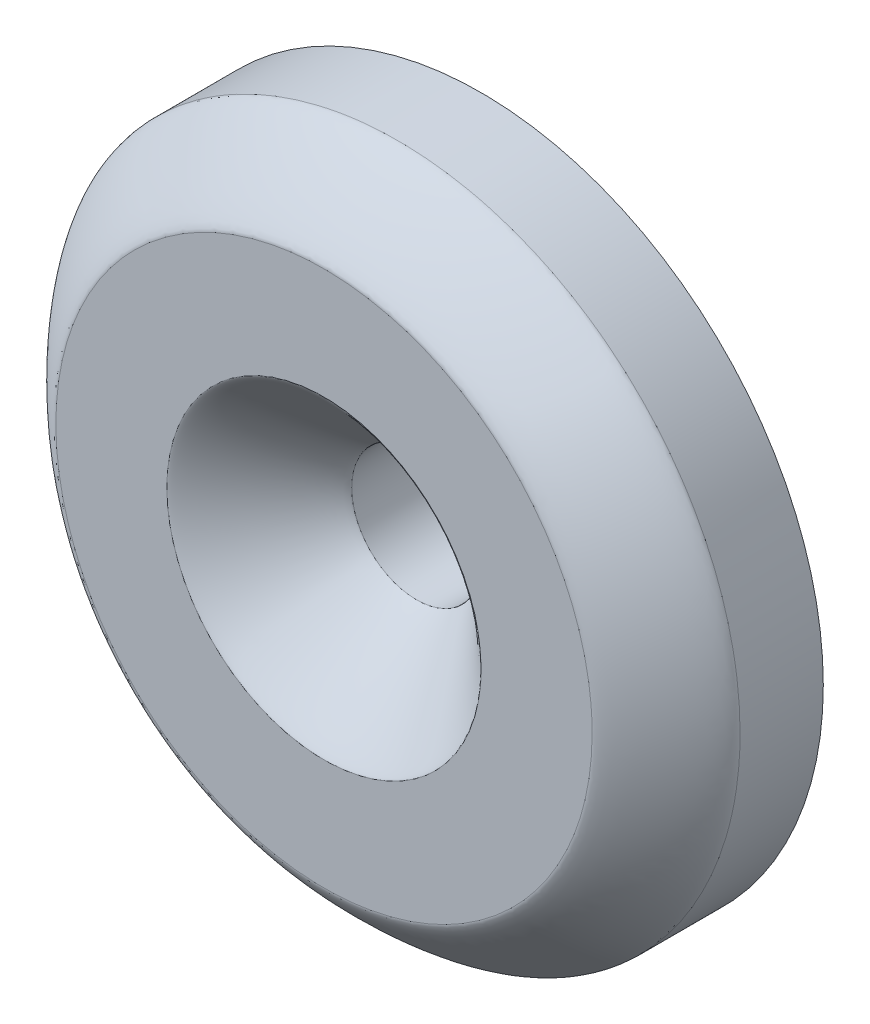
ISO-10303-21;
HEADER;
FILE_DESCRIPTION(('STEP AP214'),'2;1');
FILE_NAME('part.step','',(''),(''),'','','');
FILE_SCHEMA(('AUTOMOTIVE_DESIGN { 1 0 10303 214 1 1 1 1 }'));
ENDSEC;
DATA;
#1=APPLICATION_CONTEXT('core data for automotive mechanical design processes');
#2=APPLICATION_PROTOCOL_DEFINITION('international standard','automotive_design',2000,#1);
#3=PRODUCT_CONTEXT('',#1,'mechanical');
#4=PRODUCT('Part','Part','',(#3));
#5=PRODUCT_RELATED_PRODUCT_CATEGORY('part','',(#4));
#6=PRODUCT_DEFINITION_FORMATION('','',#4);
#7=PRODUCT_DEFINITION_CONTEXT('part definition',#1,'design');
#8=PRODUCT_DEFINITION('design','',#6,#7);
#9=PRODUCT_DEFINITION_SHAPE('','',#8);
#10=(LENGTH_UNIT() NAMED_UNIT(*) SI_UNIT(.MILLI.,.METRE.));
#11=(NAMED_UNIT(*) PLANE_ANGLE_UNIT() SI_UNIT($,.RADIAN.));
#12=(NAMED_UNIT(*) SI_UNIT($,.STERADIAN.) SOLID_ANGLE_UNIT());
#13=UNCERTAINTY_MEASURE_WITH_UNIT(LENGTH_MEASURE(1.E-05),#10,'distance_accuracy_value','');
#14=(GEOMETRIC_REPRESENTATION_CONTEXT(3) GLOBAL_UNCERTAINTY_ASSIGNED_CONTEXT((#13)) GLOBAL_UNIT_ASSIGNED_CONTEXT((#10,
#11,#12)) REPRESENTATION_CONTEXT('',''));
#15=CARTESIAN_POINT('',(0.,0.,0.));
#16=DIRECTION('',(0.,0.,1.));
#17=DIRECTION('',(1.,0.,0.));
#18=AXIS2_PLACEMENT_3D('',#15,#16,#17);
#19=CARTESIAN_POINT('',(0.,0.,0.));
#20=DIRECTION('',(0.,0.,1.));
#21=DIRECTION('',(1.,0.,0.));
#22=AXIS2_PLACEMENT_3D('',#19,#20,#21);
#23=PLANE('',#22);
#24=CARTESIAN_POINT('',(0.,0.,0.));
#25=DIRECTION('',(0.,0.,1.));
#26=DIRECTION('',(1.,0.,0.));
#27=AXIS2_PLACEMENT_3D('',#24,#25,#26);
#28=CIRCLE('',#27,6.);
#29=CARTESIAN_POINT('',(6.,0.,0.));
#30=VERTEX_POINT('',#29);
#31=EDGE_CURVE('E11',#30,#30,#28,.F.);
#32=ORIENTED_EDGE('',*,*,#31,.F.);
#33=EDGE_LOOP('',(#32));
#34=FACE_BOUND('',#33,.T.);
#35=CARTESIAN_POINT('',(0.,0.,0.));
#36=DIRECTION('',(0.,0.,-1.));
#37=DIRECTION('',(-1.,0.,0.));
#38=AXIS2_PLACEMENT_3D('',#35,#36,#37);
#39=CIRCLE('',#38,11.8);
#40=CARTESIAN_POINT('',(-11.8,0.,0.));
#41=VERTEX_POINT('',#40);
#42=EDGE_CURVE('E162',#41,#41,#39,.T.);
#43=ORIENTED_EDGE('',*,*,#42,.T.);
#44=EDGE_LOOP('',(#43));
#45=FACE_BOUND('',#44,.T.);
#46=ADVANCED_FACE('F42',(#34,#45),#23,.F.);
#47=CARTESIAN_POINT('',(0.,0.,0.));
#48=DIRECTION('',(0.,0.,-1.));
#49=DIRECTION('',(-1.,0.,0.));
#50=AXIS2_PLACEMENT_3D('',#47,#48,#49);
#51=CIRCLE('',#50,16.);
#52=CARTESIAN_POINT('',(-16.,0.,0.));
#53=VERTEX_POINT('',#52);
#54=EDGE_CURVE('E169',#53,#53,#51,.T.);
#55=ORIENTED_EDGE('',*,*,#54,.F.);
#56=EDGE_LOOP('',(#55));
#57=FACE_BOUND('',#56,.T.);
#58=CARTESIAN_POINT('',(0.,0.,0.));
#59=DIRECTION('',(0.,0.,1.));
#60=DIRECTION('',(1.,0.,0.));
#61=AXIS2_PLACEMENT_3D('',#58,#59,#60);
#62=CIRCLE('',#61,18.5);
#63=CARTESIAN_POINT('',(18.5,0.,0.));
#64=VERTEX_POINT('',#63);
#65=EDGE_CURVE('E77',#64,#64,#62,.T.);
#66=ORIENTED_EDGE('',*,*,#65,.F.);
#67=EDGE_LOOP('',(#66));
#68=FACE_BOUND('',#67,.T.);
#69=ADVANCED_FACE('F108',(#57,#68),#23,.F.);
#70=CARTESIAN_POINT('',(0.,0.,8.5));
#71=DIRECTION('',(0.,0.,1.));
#72=DIRECTION('',(1.,0.,0.));
#73=AXIS2_PLACEMENT_3D('',#70,#71,#72);
#74=PLANE('',#73);
#75=CARTESIAN_POINT('',(8.5,0.,8.5));
#76=CARTESIAN_POINT('',(8.5,1.11264739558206,8.5));
#77=CARTESIAN_POINT('',(8.27876775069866,2.22485701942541,8.5));
#78=CARTESIAN_POINT('',(7.42718430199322,4.28076133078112,8.5));
#79=CARTESIAN_POINT('',(6.79716815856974,5.22364712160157,8.5));
#80=CARTESIAN_POINT('',(5.22364712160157,6.79716815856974,8.5));
#81=CARTESIAN_POINT('',(4.2807613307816,7.42718430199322,8.5));
#82=CARTESIAN_POINT('',(2.22485701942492,8.27876775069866,8.5));
#83=CARTESIAN_POINT('',(1.11264739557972,8.5,8.5));
#84=CARTESIAN_POINT('',(-1.11264739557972,8.5,8.5));
#85=CARTESIAN_POINT('',(-2.22485701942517,8.27876775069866,8.5));
#86=CARTESIAN_POINT('',(-4.28076133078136,7.42718430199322,8.5));
#87=CARTESIAN_POINT('',(-5.22364712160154,6.79716815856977,8.5));
#88=CARTESIAN_POINT('',(-6.79716815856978,5.22364712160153,8.5));
#89=CARTESIAN_POINT('',(-7.42718430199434,4.28076133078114,8.5));
#90=CARTESIAN_POINT('',(-8.27876775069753,2.22485701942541,8.5));
#91=CARTESIAN_POINT('',(-8.5,1.11264739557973,8.5));
#92=CARTESIAN_POINT('',(-8.5,-1.11264739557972,8.5));
#93=CARTESIAN_POINT('',(-8.2787677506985,-2.22485701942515,8.5));
#94=CARTESIAN_POINT('',(-7.42718430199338,-4.28076133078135,8.5));
#95=CARTESIAN_POINT('',(-6.79716815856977,-5.22364712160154,8.5));
#96=CARTESIAN_POINT('',(-5.22364712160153,-6.79716815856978,8.5));
#97=CARTESIAN_POINT('',(-4.28076133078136,-7.42718430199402,8.5));
#98=CARTESIAN_POINT('',(-2.22485701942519,-8.27876775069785,8.5));
#99=CARTESIAN_POINT('',(-1.11264739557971,-8.5,8.5));
#100=CARTESIAN_POINT('',(1.11264739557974,-8.5,8.5));
#101=CARTESIAN_POINT('',(2.22485701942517,-8.27876775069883,8.5));
#102=CARTESIAN_POINT('',(4.28076133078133,-7.42718430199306,8.5));
#103=CARTESIAN_POINT('',(5.22364712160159,-6.79716815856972,8.5));
#104=CARTESIAN_POINT('',(6.79716815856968,-5.22364712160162,8.5));
#105=CARTESIAN_POINT('',(7.42718430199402,-4.28076133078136,8.5));
#106=CARTESIAN_POINT('',(8.27876775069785,-2.22485701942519,8.5));
#107=CARTESIAN_POINT('',(8.5,-1.11264739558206,8.5));
#108=CARTESIAN_POINT('',(8.5,0.,8.5));
#109=(BOUNDED_CURVE() B_SPLINE_CURVE(3,(#75,#76,#77,#78,#79,#80,#81,#82,#83,#84,#85,#86,#87,#88,
#89,#90,#91,#92,#93,#94,#95,#96,#97,#98,#99,#100,#101,#102,#103,#104,#105,#106,#107,#108),
.UNSPECIFIED.,.T.,.F.) B_SPLINE_CURVE_WITH_KNOTS((4,2,2,2,2,2,2,2,2,2,2,2,2,2,2,2,4),(0.,
0.392699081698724,0.785398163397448,1.17809724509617,1.5707963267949,1.96349540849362,
2.35619449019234,2.74889357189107,3.14159265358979,3.53429173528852,3.92699081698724,
4.31968989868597,4.71238898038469,5.10508806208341,5.49778714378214,5.89048622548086,
6.28318530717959),
.UNSPECIFIED.) CURVE() GEOMETRIC_REPRESENTATION_ITEM() RATIONAL_B_SPLINE_CURVE((1.,1.,1.,1.,1.,
1.,1.,1.,1.,1.,1.,1.,1.,1.,1.,1.,1.,1.,1.,1.,1.,1.,1.,1.,1.,1.,1.,1.,1.,1.,1.,1.,1.,1.)) REPRESENTATION_ITEM(''));
#110=CARTESIAN_POINT('',(8.5,0.,8.5));
#111=VERTEX_POINT('',#110);
#112=EDGE_CURVE('E54',#111,#111,#109,.F.);
#113=ORIENTED_EDGE('',*,*,#112,.T.);
#114=EDGE_LOOP('',(#113));
#115=FACE_BOUND('',#114,.T.);
#116=CARTESIAN_POINT('',(14.5,0.,8.5));
#117=CARTESIAN_POINT('',(14.5,-1.89804556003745,8.5));
#118=CARTESIAN_POINT('',(14.1226038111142,-3.79534432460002,8.5));
#119=CARTESIAN_POINT('',(12.6699026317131,-7.30247521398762,8.5));
#120=CARTESIAN_POINT('',(11.5951692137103,-8.91092744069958,8.5));
#121=CARTESIAN_POINT('',(8.91092744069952,-11.5951692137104,8.5));
#122=CARTESIAN_POINT('',(7.30247521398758,-12.6699026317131,8.5));
#123=CARTESIAN_POINT('',(3.79534432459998,-14.1226038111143,8.5));
#124=CARTESIAN_POINT('',(1.89804556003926,-14.5,8.5));
#125=CARTESIAN_POINT('',(-1.89804556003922,-14.5,8.5));
#126=CARTESIAN_POINT('',(-3.7953443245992,-14.1226038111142,8.5));
#127=CARTESIAN_POINT('',(-7.30247521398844,-12.6699026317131,8.5));
#128=CARTESIAN_POINT('',(-8.9109274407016,-11.5951692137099,8.5));
#129=CARTESIAN_POINT('',(-11.5951692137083,-8.91092744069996,8.5));
#130=CARTESIAN_POINT('',(-12.6699026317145,-7.30247521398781,8.5));
#131=CARTESIAN_POINT('',(-14.1226038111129,-3.79534432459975,8.5));
#132=CARTESIAN_POINT('',(-14.5,-1.89804556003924,8.5));
#133=CARTESIAN_POINT('',(-14.5,1.89804556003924,8.5));
#134=CARTESIAN_POINT('',(-14.1226038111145,3.79534432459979,8.5));
#135=CARTESIAN_POINT('',(-12.6699026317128,7.30247521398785,8.5));
#136=CARTESIAN_POINT('',(-11.5951692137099,8.9109274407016,8.5));
#137=CARTESIAN_POINT('',(-8.91092744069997,11.5951692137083,8.5));
#138=CARTESIAN_POINT('',(-7.30247521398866,12.6699026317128,8.5));
#139=CARTESIAN_POINT('',(-3.79534432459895,14.1226038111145,8.5));
#140=CARTESIAN_POINT('',(-1.89804556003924,14.5,8.5));
#141=CARTESIAN_POINT('',(1.89804556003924,14.5,8.5));
#142=CARTESIAN_POINT('',(3.79534432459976,14.1226038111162,8.5));
#143=CARTESIAN_POINT('',(7.30247521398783,12.6699026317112,8.5));
#144=CARTESIAN_POINT('',(8.91092744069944,11.5951692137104,8.5));
#145=CARTESIAN_POINT('',(11.5951692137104,8.91092744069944,8.5));
#146=CARTESIAN_POINT('',(12.6699026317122,7.30247521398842,8.5));
#147=CARTESIAN_POINT('',(14.1226038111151,3.79534432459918,8.5));
#148=CARTESIAN_POINT('',(14.5,1.89804556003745,8.5));
#149=CARTESIAN_POINT('',(14.5,0.,8.5));
#150=(BOUNDED_CURVE() B_SPLINE_CURVE(3,(#116,#117,#118,#119,#120,#121,#122,#123,#124,#125,#126,
#127,#128,#129,#130,#131,#132,#133,#134,#135,#136,#137,#138,#139,#140,#141,#142,#143,#144,#145,
#146,#147,#148,#149),.UNSPECIFIED.,.T.,.F.) B_SPLINE_CURVE_WITH_KNOTS((4,2,2,2,2,2,2,2,2,2,2,2,
2,2,2,2,4),(0.,0.392699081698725,0.785398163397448,1.17809724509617,1.5707963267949,
1.96349540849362,2.35619449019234,2.74889357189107,3.14159265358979,3.53429173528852,
3.92699081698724,4.31968989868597,4.71238898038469,5.10508806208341,5.49778714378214,
5.89048622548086,6.28318530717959),
.UNSPECIFIED.) CURVE() GEOMETRIC_REPRESENTATION_ITEM() RATIONAL_B_SPLINE_CURVE((1.,1.,1.,1.,1.,
1.,1.,1.,1.,1.,1.,1.,1.,1.,1.,1.,1.,1.,1.,1.,1.,1.,1.,1.,1.,1.,1.,1.,1.,1.,1.,1.,1.,1.)) REPRESENTATION_ITEM(''));
#151=CARTESIAN_POINT('',(14.5,0.,8.5));
#152=VERTEX_POINT('',#151);
#153=EDGE_CURVE('E71',#152,#152,#150,.F.);
#154=ORIENTED_EDGE('',*,*,#153,.T.);
#155=EDGE_LOOP('',(#154));
#156=FACE_BOUND('',#155,.T.);
#157=ADVANCED_FACE('F97',(#115,#156),#74,.T.);
#158=CARTESIAN_POINT('',(0.,0.,8.5));
#159=DIRECTION('',(0.,0.,-1.));
#160=DIRECTION('',(-1.,0.,0.));
#161=AXIS2_PLACEMENT_3D('',#158,#159,#160);
#162=CYLINDRICAL_SURFACE('',#161,18.5);
#163=CARTESIAN_POINT('',(18.5,0.,4.5));
#164=CARTESIAN_POINT('',(18.5,2.42164433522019,4.5));
#165=CARTESIAN_POINT('',(18.0184945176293,4.84233586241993,4.5));
#166=CARTESIAN_POINT('',(16.1650481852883,9.31695113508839,4.5));
#167=CARTESIAN_POINT('',(14.7938365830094,11.3691143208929,4.5));
#168=CARTESIAN_POINT('',(11.3691143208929,14.7938365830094,4.5));
#169=CARTESIAN_POINT('',(9.31695113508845,16.1650481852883,4.5));
#170=CARTESIAN_POINT('',(4.84233586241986,18.0184945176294,4.5));
#171=CARTESIAN_POINT('',(2.42164433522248,18.5,4.5));
#172=CARTESIAN_POINT('',(-2.42164433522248,18.5,4.5));
#173=CARTESIAN_POINT('',(-4.84233586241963,18.0184945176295,4.5));
#174=CARTESIAN_POINT('',(-9.3169511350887,16.1650481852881,4.5));
#175=CARTESIAN_POINT('',(-11.369114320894,14.7938365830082,4.5));
#176=CARTESIAN_POINT('',(-14.7938365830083,11.369114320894,4.5));
#177=CARTESIAN_POINT('',(-16.1650481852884,9.31695113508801,4.5));
#178=CARTESIAN_POINT('',(-18.0184945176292,4.84233586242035,4.5));
#179=CARTESIAN_POINT('',(-18.5,2.42164433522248,4.5));
#180=CARTESIAN_POINT('',(-18.5,-2.42164433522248,4.5));
#181=CARTESIAN_POINT('',(-18.0184945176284,-4.84233586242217,4.5));
#182=CARTESIAN_POINT('',(-16.1650481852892,-9.3169511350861,4.5));
#183=CARTESIAN_POINT('',(-14.7938365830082,-11.369114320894,4.5));
#184=CARTESIAN_POINT('',(-11.369114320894,-14.7938365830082,4.5));
#185=CARTESIAN_POINT('',(-9.31695113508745,-16.1650481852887,4.5));
#186=CARTESIAN_POINT('',(-4.84233586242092,-18.0184945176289,4.5));
#187=CARTESIAN_POINT('',(-2.42164433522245,-18.5,4.5));
#188=CARTESIAN_POINT('',(2.42164433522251,-18.5,4.5));
#189=CARTESIAN_POINT('',(4.84233586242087,-18.0184945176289,4.5));
#190=CARTESIAN_POINT('',(9.3169511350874,-16.1650481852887,4.5));
#191=CARTESIAN_POINT('',(11.369114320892,-14.7938365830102,4.5));
#192=CARTESIAN_POINT('',(14.7938365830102,-11.3691143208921,4.5));
#193=CARTESIAN_POINT('',(16.1650481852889,-9.31695113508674,4.5));
#194=CARTESIAN_POINT('',(18.0184945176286,-4.84233586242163,4.5));
#195=CARTESIAN_POINT('',(18.5,-2.42164433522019,4.5));
#196=CARTESIAN_POINT('',(18.5,0.,4.5));
#197=(BOUNDED_CURVE() B_SPLINE_CURVE(3,(#163,#164,#165,#166,#167,#168,#169,#170,#171,#172,#173,
#174,#175,#176,#177,#178,#179,#180,#181,#182,#183,#184,#185,#186,#187,#188,#189,#190,#191,#192,
#193,#194,#195,#196),.UNSPECIFIED.,.T.,.F.) B_SPLINE_CURVE_WITH_KNOTS((4,2,2,2,2,2,2,2,2,2,2,2,
2,2,2,2,4),(0.,0.392699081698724,0.785398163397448,1.17809724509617,1.5707963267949,
1.96349540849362,2.35619449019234,2.74889357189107,3.14159265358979,3.53429173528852,
3.92699081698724,4.31968989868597,4.71238898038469,5.10508806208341,5.49778714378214,
5.89048622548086,6.28318530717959),
.UNSPECIFIED.) CURVE() GEOMETRIC_REPRESENTATION_ITEM() RATIONAL_B_SPLINE_CURVE((1.,1.,1.,1.,1.,
1.,1.,1.,1.,1.,1.,1.,1.,1.,1.,1.,1.,1.,1.,1.,1.,1.,1.,1.,1.,1.,1.,1.,1.,1.,1.,1.,1.,1.)) REPRESENTATION_ITEM(''));
#198=CARTESIAN_POINT('',(18.5,0.,4.5));
#199=VERTEX_POINT('',#198);
#200=EDGE_CURVE('E65',#199,#199,#197,.F.);
#201=ORIENTED_EDGE('',*,*,#200,.T.);
#202=EDGE_LOOP('',(#201));
#203=FACE_BOUND('',#202,.T.);
#204=ORIENTED_EDGE('',*,*,#65,.T.);
#205=EDGE_LOOP('',(#204));
#206=FACE_BOUND('',#205,.T.);
#207=ADVANCED_FACE('F107',(#203,#206),#162,.T.);
#208=CARTESIAN_POINT('',(0.,0.,8.5));
#209=DIRECTION('',(0.,0.,-1.));
#210=DIRECTION('',(-1.,0.,0.));
#211=AXIS2_PLACEMENT_3D('',#208,#209,#210);
#212=CYLINDRICAL_SURFACE('',#211,3.5);
#213=CARTESIAN_POINT('',(3.5,0.,3.5));
#214=CARTESIAN_POINT('',(3.5,-0.458148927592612,3.5));
#215=CARTESIAN_POINT('',(3.40890436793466,-0.916117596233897,3.5));
#216=CARTESIAN_POINT('',(3.05825235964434,-1.76266643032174,3.5));
#217=CARTESIAN_POINT('',(2.79883394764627,-2.15091352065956,3.5));
#218=CARTESIAN_POINT('',(2.15091352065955,-2.79883394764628,3.5));
#219=CARTESIAN_POINT('',(1.76266643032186,-3.05825235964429,3.5));
#220=CARTESIAN_POINT('',(0.916117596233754,-3.40890436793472,3.5));
#221=CARTESIAN_POINT('',(0.458148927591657,-3.5,3.5));
#222=CARTESIAN_POINT('',(-0.458148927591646,-3.5,3.5));
#223=CARTESIAN_POINT('',(-0.9161175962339,-3.40890436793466,3.5));
#224=CARTESIAN_POINT('',(-1.76266643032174,-3.05825235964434,3.5));
#225=CARTESIAN_POINT('',(-2.1509135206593,-2.79883394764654,3.5));
#226=CARTESIAN_POINT('',(-2.79883394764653,-2.1509135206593,3.5));
#227=CARTESIAN_POINT('',(-3.05825235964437,-1.76266643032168,3.5));
#228=CARTESIAN_POINT('',(-3.40890436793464,-0.91611759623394,3.5));
#229=CARTESIAN_POINT('',(-3.5,-0.458148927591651,3.5));
#230=CARTESIAN_POINT('',(-3.5,0.458148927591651,3.5));
#231=CARTESIAN_POINT('',(-3.40890436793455,0.916117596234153,3.5));
#232=CARTESIAN_POINT('',(-3.05825235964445,1.76266643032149,3.5));
#233=CARTESIAN_POINT('',(-2.79883394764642,2.15091352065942,3.5));
#234=CARTESIAN_POINT('',(-2.15091352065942,2.79883394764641,3.5));
#235=CARTESIAN_POINT('',(-1.76266643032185,3.0582523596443,3.5));
#236=CARTESIAN_POINT('',(-0.916117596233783,3.40890436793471,3.5));
#237=CARTESIAN_POINT('',(-0.458148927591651,3.5,3.5));
#238=CARTESIAN_POINT('',(0.458148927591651,3.5,3.5));
#239=CARTESIAN_POINT('',(0.91611759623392,3.40890436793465,3.5));
#240=CARTESIAN_POINT('',(1.76266643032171,3.05825235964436,3.5));
#241=CARTESIAN_POINT('',(2.15091352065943,2.79883394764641,3.5));
#242=CARTESIAN_POINT('',(2.79883394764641,2.15091352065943,3.5));
#243=CARTESIAN_POINT('',(3.05825235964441,1.76266643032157,3.5));
#244=CARTESIAN_POINT('',(3.40890436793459,0.916117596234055,3.5));
#245=CARTESIAN_POINT('',(3.5,0.458148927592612,3.5));
#246=CARTESIAN_POINT('',(3.5,0.,3.5));
#247=(BOUNDED_CURVE() B_SPLINE_CURVE(3,(#213,#214,#215,#216,#217,#218,#219,#220,#221,#222,#223,
#224,#225,#226,#227,#228,#229,#230,#231,#232,#233,#234,#235,#236,#237,#238,#239,#240,#241,#242,
#243,#244,#245,#246),.UNSPECIFIED.,.T.,.F.) B_SPLINE_CURVE_WITH_KNOTS((4,2,2,2,2,2,2,2,2,2,2,2,
2,2,2,2,4),(0.,0.392699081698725,0.785398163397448,1.17809724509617,1.5707963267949,
1.96349540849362,2.35619449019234,2.74889357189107,3.14159265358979,3.53429173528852,
3.92699081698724,4.31968989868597,4.71238898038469,5.10508806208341,5.49778714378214,
5.89048622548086,6.28318530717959),
.UNSPECIFIED.) CURVE() GEOMETRIC_REPRESENTATION_ITEM() RATIONAL_B_SPLINE_CURVE((1.,1.,1.,1.,1.,
1.,1.,1.,1.,1.,1.,1.,1.,1.,1.,1.,1.,1.,1.,1.,1.,1.,1.,1.,1.,1.,1.,1.,1.,1.,1.,1.,1.,1.)) REPRESENTATION_ITEM(''));
#248=CARTESIAN_POINT('',(3.5,0.,3.5));
#249=VERTEX_POINT('',#248);
#250=EDGE_CURVE('E59',#249,#249,#247,.F.);
#251=ORIENTED_EDGE('',*,*,#250,.T.);
#252=EDGE_LOOP('',(#251));
#253=FACE_BOUND('',#252,.T.);
#254=CARTESIAN_POINT('',(0.,0.,-2.));
#255=DIRECTION('',(0.,0.,-1.));
#256=DIRECTION('',(-1.,0.,0.));
#257=AXIS2_PLACEMENT_3D('',#254,#255,#256);
#258=CIRCLE('',#257,3.5);
#259=CARTESIAN_POINT('',(-3.5,0.,-2.));
#260=VERTEX_POINT('',#259);
#261=EDGE_CURVE('E89',#260,#260,#258,.T.);
#262=ORIENTED_EDGE('',*,*,#261,.T.);
#263=EDGE_LOOP('',(#262));
#264=FACE_BOUND('',#263,.T.);
#265=ADVANCED_FACE('F109',(#253,#264),#212,.F.);
#266=CARTESIAN_POINT('',(14.5,0.,8.5));
#267=CARTESIAN_POINT('',(14.5,1.89804556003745,8.5));
#268=CARTESIAN_POINT('',(14.1226038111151,3.79534432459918,8.5));
#269=CARTESIAN_POINT('',(12.6699026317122,7.30247521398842,8.5));
#270=CARTESIAN_POINT('',(11.5951692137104,8.91092744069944,8.5));
#271=CARTESIAN_POINT('',(8.91092744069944,11.5951692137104,8.5));
#272=CARTESIAN_POINT('',(7.30247521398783,12.6699026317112,8.5));
#273=CARTESIAN_POINT('',(3.79534432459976,14.1226038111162,8.5));
#274=CARTESIAN_POINT('',(1.89804556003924,14.5,8.5));
#275=CARTESIAN_POINT('',(-1.89804556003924,14.5,8.5));
#276=CARTESIAN_POINT('',(-3.79534432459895,14.1226038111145,8.5));
#277=CARTESIAN_POINT('',(-7.30247521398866,12.6699026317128,8.5));
#278=CARTESIAN_POINT('',(-8.91092744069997,11.5951692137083,8.5));
#279=CARTESIAN_POINT('',(-11.5951692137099,8.9109274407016,8.5));
#280=CARTESIAN_POINT('',(-12.6699026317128,7.30247521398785,8.5));
#281=CARTESIAN_POINT('',(-14.1226038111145,3.79534432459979,8.5));
#282=CARTESIAN_POINT('',(-14.5,1.89804556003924,8.5));
#283=CARTESIAN_POINT('',(-14.5,-1.89804556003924,8.5));
#284=CARTESIAN_POINT('',(-14.1226038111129,-3.79534432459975,8.5));
#285=CARTESIAN_POINT('',(-12.6699026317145,-7.30247521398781,8.5));
#286=CARTESIAN_POINT('',(-11.5951692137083,-8.91092744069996,8.5));
#287=CARTESIAN_POINT('',(-8.9109274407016,-11.5951692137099,8.5));
#288=CARTESIAN_POINT('',(-7.30247521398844,-12.6699026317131,8.5));
#289=CARTESIAN_POINT('',(-3.7953443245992,-14.1226038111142,8.5));
#290=CARTESIAN_POINT('',(-1.89804556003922,-14.5,8.5));
#291=CARTESIAN_POINT('',(1.89804556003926,-14.5,8.5));
#292=CARTESIAN_POINT('',(3.79534432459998,-14.1226038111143,8.5));
#293=CARTESIAN_POINT('',(7.30247521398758,-12.6699026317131,8.5));
#294=CARTESIAN_POINT('',(8.91092744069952,-11.5951692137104,8.5));
#295=CARTESIAN_POINT('',(11.5951692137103,-8.91092744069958,8.5));
#296=CARTESIAN_POINT('',(12.6699026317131,-7.30247521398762,8.5));
#297=CARTESIAN_POINT('',(14.1226038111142,-3.79534432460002,8.5));
#298=CARTESIAN_POINT('',(14.5,-1.89804556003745,8.5));
#299=CARTESIAN_POINT('',(14.5,0.,8.5));
#300=CARTESIAN_POINT('',(18.5,0.,8.5));
#301=CARTESIAN_POINT('',(18.5,2.42164433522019,8.5));
#302=CARTESIAN_POINT('',(18.0184945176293,4.84233586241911,8.5));
#303=CARTESIAN_POINT('',(16.1650481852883,9.31695113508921,8.5));
#304=CARTESIAN_POINT('',(14.7938365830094,11.3691143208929,8.5));
#305=CARTESIAN_POINT('',(11.3691143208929,14.7938365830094,8.5));
#306=CARTESIAN_POINT('',(9.31695113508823,16.1650481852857,8.50000000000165));
#307=CARTESIAN_POINT('',(4.84233586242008,18.0184945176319,8.49999999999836));
#308=CARTESIAN_POINT('',(2.42164433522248,18.5,8.5));
#309=CARTESIAN_POINT('',(-2.42164433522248,18.5,8.5));
#310=CARTESIAN_POINT('',(-4.84233586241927,18.0184945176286,8.49999999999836));
#311=CARTESIAN_POINT('',(-9.31695113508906,16.165048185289,8.50000000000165));
#312=CARTESIAN_POINT('',(-11.369114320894,14.7938365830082,8.5));
#313=CARTESIAN_POINT('',(-14.7938365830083,11.369114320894,8.5));
#314=CARTESIAN_POINT('',(-16.165048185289,9.31695113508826,8.5));
#315=CARTESIAN_POINT('',(-18.0184945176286,4.84233586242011,8.5));
#316=CARTESIAN_POINT('',(-18.5,2.42164433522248,8.5));
#317=CARTESIAN_POINT('',(-18.5,-2.42164433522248,8.5));
#318=CARTESIAN_POINT('',(-18.0184945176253,-4.84233586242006,8.5));
#319=CARTESIAN_POINT('',(-16.1650481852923,-9.31695113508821,8.5));
#320=CARTESIAN_POINT('',(-14.7938365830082,-11.369114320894,8.5));
#321=CARTESIAN_POINT('',(-11.369114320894,-14.7938365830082,8.5));
#322=CARTESIAN_POINT('',(-9.31695113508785,-16.1650481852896,8.50000000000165));
#323=CARTESIAN_POINT('',(-4.84233586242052,-18.018494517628,8.49999999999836));
#324=CARTESIAN_POINT('',(-2.42164433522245,-18.5,8.5));
#325=CARTESIAN_POINT('',(2.42164433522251,-18.5,8.5));
#326=CARTESIAN_POINT('',(4.84233586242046,-18.018494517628,8.5));
#327=CARTESIAN_POINT('',(9.3169511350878,-16.1650481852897,8.5));
#328=CARTESIAN_POINT('',(11.3691143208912,-14.7938365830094,8.5));
#329=CARTESIAN_POINT('',(14.793836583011,-11.3691143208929,8.5));
#330=CARTESIAN_POINT('',(16.1650481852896,-9.31695113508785,8.50000000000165));
#331=CARTESIAN_POINT('',(18.018494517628,-4.84233586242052,8.49999999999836));
#332=CARTESIAN_POINT('',(18.5,-2.42164433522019,8.5));
#333=CARTESIAN_POINT('',(18.5,0.,8.5));
#334=CARTESIAN_POINT('',(18.5,0.,4.5));
#335=CARTESIAN_POINT('',(18.5,2.42164433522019,4.5));
#336=CARTESIAN_POINT('',(18.0184945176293,4.84233586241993,4.5));
#337=CARTESIAN_POINT('',(16.1650481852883,9.31695113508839,4.5));
#338=CARTESIAN_POINT('',(14.7938365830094,11.3691143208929,4.5));
#339=CARTESIAN_POINT('',(11.3691143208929,14.7938365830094,4.5));
#340=CARTESIAN_POINT('',(9.31695113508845,16.1650481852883,4.5));
#341=CARTESIAN_POINT('',(4.84233586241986,18.0184945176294,4.5));
#342=CARTESIAN_POINT('',(2.42164433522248,18.5,4.5));
#343=CARTESIAN_POINT('',(-2.42164433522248,18.5,4.5));
#344=CARTESIAN_POINT('',(-4.84233586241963,18.0184945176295,4.5));
#345=CARTESIAN_POINT('',(-9.3169511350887,16.1650481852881,4.5));
#346=CARTESIAN_POINT('',(-11.369114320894,14.7938365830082,4.5));
#347=CARTESIAN_POINT('',(-14.7938365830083,11.369114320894,4.5));
#348=CARTESIAN_POINT('',(-16.1650481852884,9.31695113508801,4.5));
#349=CARTESIAN_POINT('',(-18.0184945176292,4.84233586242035,4.5));
#350=CARTESIAN_POINT('',(-18.5,2.42164433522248,4.5));
#351=CARTESIAN_POINT('',(-18.5,-2.42164433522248,4.5));
#352=CARTESIAN_POINT('',(-18.0184945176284,-4.84233586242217,4.5));
#353=CARTESIAN_POINT('',(-16.1650481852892,-9.3169511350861,4.5));
#354=CARTESIAN_POINT('',(-14.7938365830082,-11.369114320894,4.5));
#355=CARTESIAN_POINT('',(-11.369114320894,-14.7938365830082,4.5));
#356=CARTESIAN_POINT('',(-9.31695113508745,-16.1650481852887,4.5));
#357=CARTESIAN_POINT('',(-4.84233586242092,-18.0184945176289,4.5));
#358=CARTESIAN_POINT('',(-2.42164433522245,-18.5,4.5));
#359=CARTESIAN_POINT('',(2.42164433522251,-18.5,4.5));
#360=CARTESIAN_POINT('',(4.84233586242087,-18.0184945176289,4.5));
#361=CARTESIAN_POINT('',(9.3169511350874,-16.1650481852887,4.5));
#362=CARTESIAN_POINT('',(11.369114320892,-14.7938365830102,4.5));
#363=CARTESIAN_POINT('',(14.7938365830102,-11.3691143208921,4.5));
#364=CARTESIAN_POINT('',(16.1650481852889,-9.31695113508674,4.5));
#365=CARTESIAN_POINT('',(18.0184945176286,-4.84233586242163,4.5));
#366=CARTESIAN_POINT('',(18.5,-2.42164433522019,4.5));
#367=CARTESIAN_POINT('',(18.5,0.,4.5));
#368=(BOUNDED_SURFACE() B_SPLINE_SURFACE(2,3,((#266,#267,#268,#269,#270,#271,#272,#273,#274,
#275,#276,#277,#278,#279,#280,#281,#282,#283,#284,#285,#286,#287,#288,#289,#290,#291,#292,#293,
#294,#295,#296,#297,#298,#299),(#300,#301,#302,#303,#304,#305,#306,#307,#308,#309,#310,#311,
#312,#313,#314,#315,#316,#317,#318,#319,#320,#321,#322,#323,#324,#325,#326,#327,#328,#329,#330,
#331,#332,#333),(#334,#335,#336,#337,#338,#339,#340,#341,#342,#343,#344,#345,#346,#347,#348,
#349,#350,#351,#352,#353,#354,#355,#356,#357,#358,#359,#360,#361,#362,#363,#364,#365,#366,
#367)),.UNSPECIFIED.,.F.,.T.,.F.) B_SPLINE_SURFACE_WITH_KNOTS((3,3),(4,2,2,2,2,2,2,2,2,2,2,2,2,
2,2,2,4),(0.,1.),(0.,0.392699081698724,0.785398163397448,1.17809724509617,1.5707963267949,
1.96349540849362,2.35619449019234,2.74889357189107,3.14159265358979,3.53429173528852,
3.92699081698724,4.31968989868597,4.71238898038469,5.10508806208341,5.49778714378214,
5.89048622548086,6.28318530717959),
.UNSPECIFIED.) GEOMETRIC_REPRESENTATION_ITEM() RATIONAL_B_SPLINE_SURFACE(((1.,1.,1.,1.,1.,1.,1.,
1.,1.,1.,1.,1.,1.,1.,1.,1.,1.,1.,1.,1.,1.,1.,1.,1.,1.,1.,1.,1.,1.,1.,1.,1.,1.,1.),
(0.14142135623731,0.14142135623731,0.14142135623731,0.14142135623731,0.14142135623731,
0.14142135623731,0.14142135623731,0.14142135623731,0.14142135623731,0.14142135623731,
0.14142135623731,0.14142135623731,0.14142135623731,0.14142135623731,0.141421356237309,
0.141421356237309,0.14142135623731,0.14142135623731,0.141421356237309,0.141421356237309,
0.14142135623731,0.14142135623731,0.141421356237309,0.141421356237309,0.14142135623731,
0.14142135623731,0.141421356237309,0.141421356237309,0.14142135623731,0.14142135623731,
0.141421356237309,0.141421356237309,0.14142135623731,0.14142135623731),(1.,1.,1.,1.,1.,1.,1.,1.,
1.,1.,1.,1.,1.,1.,1.,1.,1.,1.,1.,1.,1.,1.,1.,1.,1.,1.,1.,1.,1.,1.,1.,1.,1.,1.))) REPRESENTATION_ITEM('') SURFACE());
#369=ORIENTED_EDGE('',*,*,#200,.F.);
#370=EDGE_LOOP('',(#369));
#371=FACE_BOUND('',#370,.T.);
#372=ORIENTED_EDGE('',*,*,#153,.F.);
#373=EDGE_LOOP('',(#372));
#374=FACE_BOUND('',#373,.T.);
#375=ADVANCED_FACE('F144',(#371,#374),#368,.T.);
#376=CARTESIAN_POINT('',(3.5,0.,3.5));
#377=CARTESIAN_POINT('',(3.5,0.458148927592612,3.5));
#378=CARTESIAN_POINT('',(3.40890436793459,0.916117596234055,3.5));
#379=CARTESIAN_POINT('',(3.05825235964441,1.76266643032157,3.5));
#380=CARTESIAN_POINT('',(2.79883394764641,2.15091352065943,3.5));
#381=CARTESIAN_POINT('',(2.15091352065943,2.79883394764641,3.5));
#382=CARTESIAN_POINT('',(1.76266643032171,3.05825235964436,3.5));
#383=CARTESIAN_POINT('',(0.91611759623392,3.40890436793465,3.5));
#384=CARTESIAN_POINT('',(0.458148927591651,3.5,3.5));
#385=CARTESIAN_POINT('',(-0.458148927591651,3.5,3.5));
#386=CARTESIAN_POINT('',(-0.916117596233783,3.40890436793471,3.5));
#387=CARTESIAN_POINT('',(-1.76266643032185,3.0582523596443,3.5));
#388=CARTESIAN_POINT('',(-2.15091352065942,2.79883394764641,3.5));
#389=CARTESIAN_POINT('',(-2.79883394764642,2.15091352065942,3.5));
#390=CARTESIAN_POINT('',(-3.05825235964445,1.76266643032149,3.5));
#391=CARTESIAN_POINT('',(-3.40890436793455,0.916117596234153,3.5));
#392=CARTESIAN_POINT('',(-3.5,0.458148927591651,3.5));
#393=CARTESIAN_POINT('',(-3.5,-0.458148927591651,3.5));
#394=CARTESIAN_POINT('',(-3.40890436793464,-0.91611759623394,3.5));
#395=CARTESIAN_POINT('',(-3.05825235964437,-1.76266643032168,3.5));
#396=CARTESIAN_POINT('',(-2.79883394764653,-2.1509135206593,3.5));
#397=CARTESIAN_POINT('',(-2.1509135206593,-2.79883394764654,3.5));
#398=CARTESIAN_POINT('',(-1.76266643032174,-3.05825235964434,3.5));
#399=CARTESIAN_POINT('',(-0.9161175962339,-3.40890436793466,3.5));
#400=CARTESIAN_POINT('',(-0.458148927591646,-3.5,3.5));
#401=CARTESIAN_POINT('',(0.458148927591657,-3.5,3.5));
#402=CARTESIAN_POINT('',(0.916117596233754,-3.40890436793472,3.5));
#403=CARTESIAN_POINT('',(1.76266643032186,-3.05825235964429,3.5));
#404=CARTESIAN_POINT('',(2.15091352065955,-2.79883394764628,3.5));
#405=CARTESIAN_POINT('',(2.79883394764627,-2.15091352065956,3.5));
#406=CARTESIAN_POINT('',(3.05825235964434,-1.76266643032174,3.5));
#407=CARTESIAN_POINT('',(3.40890436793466,-0.916117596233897,3.5));
#408=CARTESIAN_POINT('',(3.5,-0.458148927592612,3.5));
#409=CARTESIAN_POINT('',(3.5,0.,3.5));
#410=CARTESIAN_POINT('',(3.5,0.,8.5));
#411=CARTESIAN_POINT('',(3.49999999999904,0.458148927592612,8.50000000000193));
#412=CARTESIAN_POINT('',(3.4089043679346,0.916117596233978,8.5));
#413=CARTESIAN_POINT('',(3.05825235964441,1.76266643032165,8.5));
#414=CARTESIAN_POINT('',(2.79883394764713,2.1509135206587,8.5));
#415=CARTESIAN_POINT('',(2.1509135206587,2.79883394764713,8.5));
#416=CARTESIAN_POINT('',(1.76266643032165,3.05825235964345,8.5));
#417=CARTESIAN_POINT('',(0.916117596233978,3.40890436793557,8.5));
#418=CARTESIAN_POINT('',(0.458148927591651,3.5,8.5));
#419=CARTESIAN_POINT('',(-0.458148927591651,3.5,8.5));
#420=CARTESIAN_POINT('',(-0.916117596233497,3.40890436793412,8.5));
#421=CARTESIAN_POINT('',(-1.76266643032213,3.05825235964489,8.5));
#422=CARTESIAN_POINT('',(-2.15091352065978,2.79883394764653,8.5));
#423=CARTESIAN_POINT('',(-2.79883394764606,2.1509135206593,8.5));
#424=CARTESIAN_POINT('',(-3.05825235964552,1.76266643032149,8.5));
#425=CARTESIAN_POINT('',(-3.40890436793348,0.91611759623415,8.5));
#426=CARTESIAN_POINT('',(-3.5,0.458148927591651,8.5));
#427=CARTESIAN_POINT('',(-3.5,-0.45814892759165,8.5));
#428=CARTESIAN_POINT('',(-3.40890436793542,-0.916117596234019,8.49999999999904));
#429=CARTESIAN_POINT('',(-3.0582523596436,-1.7626664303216,8.50000000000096));
#430=CARTESIAN_POINT('',(-2.79883394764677,-2.15091352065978,8.5));
#431=CARTESIAN_POINT('',(-2.15091352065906,-2.79883394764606,8.5));
#432=CARTESIAN_POINT('',(-1.76266643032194,-3.05825235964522,8.5));
#433=CARTESIAN_POINT('',(-0.916117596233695,-3.40890436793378,8.5));
#434=CARTESIAN_POINT('',(-0.458148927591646,-3.5,8.5));
#435=CARTESIAN_POINT('',(0.458148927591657,-3.5,8.5));
#436=CARTESIAN_POINT('',(0.916117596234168,-3.4089043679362,8.5));
#437=CARTESIAN_POINT('',(1.76266643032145,-3.05825235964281,8.5));
#438=CARTESIAN_POINT('',(2.15091352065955,-2.79883394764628,8.5));
#439=CARTESIAN_POINT('',(2.79883394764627,-2.15091352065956,8.5));
#440=CARTESIAN_POINT('',(3.05825235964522,-1.76266643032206,8.5));
#441=CARTESIAN_POINT('',(3.40890436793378,-0.916117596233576,8.5));
#442=CARTESIAN_POINT('',(3.50000000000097,-0.458148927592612,8.49999999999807));
#443=CARTESIAN_POINT('',(3.5,0.,8.5));
#444=CARTESIAN_POINT('',(8.5,0.,8.5));
#445=CARTESIAN_POINT('',(8.5,1.11264739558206,8.5));
#446=CARTESIAN_POINT('',(8.27876775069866,2.22485701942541,8.5));
#447=CARTESIAN_POINT('',(7.42718430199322,4.28076133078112,8.5));
#448=CARTESIAN_POINT('',(6.79716815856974,5.22364712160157,8.5));
#449=CARTESIAN_POINT('',(5.22364712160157,6.79716815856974,8.5));
#450=CARTESIAN_POINT('',(4.2807613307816,7.42718430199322,8.5));
#451=CARTESIAN_POINT('',(2.22485701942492,8.27876775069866,8.5));
#452=CARTESIAN_POINT('',(1.11264739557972,8.5,8.5));
#453=CARTESIAN_POINT('',(-1.11264739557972,8.5,8.5));
#454=CARTESIAN_POINT('',(-2.22485701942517,8.27876775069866,8.5));
#455=CARTESIAN_POINT('',(-4.28076133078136,7.42718430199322,8.5));
#456=CARTESIAN_POINT('',(-5.22364712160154,6.79716815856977,8.5));
#457=CARTESIAN_POINT('',(-6.79716815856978,5.22364712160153,8.5));
#458=CARTESIAN_POINT('',(-7.42718430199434,4.28076133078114,8.5));
#459=CARTESIAN_POINT('',(-8.27876775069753,2.22485701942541,8.5));
#460=CARTESIAN_POINT('',(-8.5,1.11264739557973,8.5));
#461=CARTESIAN_POINT('',(-8.5,-1.11264739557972,8.5));
#462=CARTESIAN_POINT('',(-8.2787677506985,-2.22485701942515,8.5));
#463=CARTESIAN_POINT('',(-7.42718430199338,-4.28076133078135,8.5));
#464=CARTESIAN_POINT('',(-6.79716815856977,-5.22364712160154,8.5));
#465=CARTESIAN_POINT('',(-5.22364712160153,-6.79716815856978,8.5));
#466=CARTESIAN_POINT('',(-4.28076133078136,-7.42718430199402,8.5));
#467=CARTESIAN_POINT('',(-2.22485701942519,-8.27876775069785,8.5));
#468=CARTESIAN_POINT('',(-1.11264739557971,-8.5,8.5));
#469=CARTESIAN_POINT('',(1.11264739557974,-8.5,8.5));
#470=CARTESIAN_POINT('',(2.22485701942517,-8.27876775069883,8.5));
#471=CARTESIAN_POINT('',(4.28076133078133,-7.42718430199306,8.5));
#472=CARTESIAN_POINT('',(5.22364712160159,-6.79716815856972,8.5));
#473=CARTESIAN_POINT('',(6.79716815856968,-5.22364712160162,8.5));
#474=CARTESIAN_POINT('',(7.42718430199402,-4.28076133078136,8.5));
#475=CARTESIAN_POINT('',(8.27876775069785,-2.22485701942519,8.5));
#476=CARTESIAN_POINT('',(8.5,-1.11264739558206,8.5));
#477=CARTESIAN_POINT('',(8.5,0.,8.5));
#478=(BOUNDED_SURFACE() B_SPLINE_SURFACE(2,3,((#376,#377,#378,#379,#380,#381,#382,#383,#384,
#385,#386,#387,#388,#389,#390,#391,#392,#393,#394,#395,#396,#397,#398,#399,#400,#401,#402,#403,
#404,#405,#406,#407,#408,#409),(#410,#411,#412,#413,#414,#415,#416,#417,#418,#419,#420,#421,
#422,#423,#424,#425,#426,#427,#428,#429,#430,#431,#432,#433,#434,#435,#436,#437,#438,#439,#440,
#441,#442,#443),(#444,#445,#446,#447,#448,#449,#450,#451,#452,#453,#454,#455,#456,#457,#458,
#459,#460,#461,#462,#463,#464,#465,#466,#467,#468,#469,#470,#471,#472,#473,#474,#475,#476,
#477)),.UNSPECIFIED.,.F.,.T.,.F.) B_SPLINE_SURFACE_WITH_KNOTS((3,3),(4,2,2,2,2,2,2,2,2,2,2,2,2,
2,2,2,4),(0.,1.),(0.,0.392699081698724,0.785398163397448,1.17809724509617,1.5707963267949,
1.96349540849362,2.35619449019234,2.74889357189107,3.14159265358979,3.53429173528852,
3.92699081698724,4.31968989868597,4.71238898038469,5.10508806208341,5.49778714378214,
5.89048622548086,6.28318530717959),
.UNSPECIFIED.) GEOMETRIC_REPRESENTATION_ITEM() RATIONAL_B_SPLINE_SURFACE(((1.,1.,1.,1.,1.,1.,1.,
1.,1.,1.,1.,1.,1.,1.,1.,1.,1.,1.,1.,1.,1.,1.,1.,1.,1.,1.,1.,1.,1.,1.,1.,1.,1.,1.),
(0.0526315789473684,0.0526315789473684,0.0526315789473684,0.0526315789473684,0.0526315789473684,
0.0526315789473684,0.0526315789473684,0.0526315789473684,0.0526315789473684,0.0526315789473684,
0.0526315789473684,0.0526315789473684,0.0526315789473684,0.0526315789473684,0.0526315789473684,
0.0526315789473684,0.0526315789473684,0.0526315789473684,0.0526315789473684,0.0526315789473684,
0.0526315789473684,0.0526315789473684,0.0526315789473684,0.0526315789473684,0.0526315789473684,
0.0526315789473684,0.0526315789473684,0.0526315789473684,0.0526315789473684,0.0526315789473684,
0.0526315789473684,0.0526315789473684,0.0526315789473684,0.0526315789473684),(1.,1.,1.,1.,1.,1.,
1.,1.,1.,1.,1.,1.,1.,1.,1.,1.,1.,1.,1.,1.,1.,1.,1.,1.,1.,1.,1.,1.,1.,1.,1.,1.,1.,1.))) REPRESENTATION_ITEM('') SURFACE());
#479=ORIENTED_EDGE('',*,*,#112,.F.);
#480=EDGE_LOOP('',(#479));
#481=FACE_BOUND('',#480,.T.);
#482=ORIENTED_EDGE('',*,*,#250,.F.);
#483=EDGE_LOOP('',(#482));
#484=FACE_BOUND('',#483,.T.);
#485=ADVANCED_FACE('F45',(#481,#484),#478,.T.);
#486=CARTESIAN_POINT('',(0.,0.,-2.));
#487=DIRECTION('',(0.,0.,-1.));
#488=DIRECTION('',(-1.,0.,0.));
#489=AXIS2_PLACEMENT_3D('',#486,#487,#488);
#490=PLANE('',#489);
#491=CARTESIAN_POINT('',(0.,0.,-2.));
#492=DIRECTION('',(0.,0.,-1.));
#493=DIRECTION('',(-1.,0.,0.));
#494=AXIS2_PLACEMENT_3D('',#491,#492,#493);
#495=CIRCLE('',#494,6.);
#496=CARTESIAN_POINT('',(-6.,0.,-2.));
#497=VERTEX_POINT('',#496);
#498=EDGE_CURVE('E83',#497,#497,#495,.T.);
#499=ORIENTED_EDGE('',*,*,#498,.T.);
#500=EDGE_LOOP('',(#499));
#501=FACE_BOUND('',#500,.T.);
#502=ORIENTED_EDGE('',*,*,#261,.F.);
#503=EDGE_LOOP('',(#502));
#504=FACE_BOUND('',#503,.T.);
#505=ADVANCED_FACE('F143',(#501,#504),#490,.T.);
#506=CARTESIAN_POINT('',(0.,0.,-2.));
#507=DIRECTION('',(0.,0.,1.));
#508=DIRECTION('',(1.,0.,0.));
#509=AXIS2_PLACEMENT_3D('',#506,#507,#508);
#510=CYLINDRICAL_SURFACE('',#509,6.);
#511=ORIENTED_EDGE('',*,*,#498,.F.);
#512=EDGE_LOOP('',(#511));
#513=FACE_BOUND('',#512,.T.);
#514=ORIENTED_EDGE('',*,*,#31,.T.);
#515=EDGE_LOOP('',(#514));
#516=FACE_BOUND('',#515,.T.);
#517=ADVANCED_FACE('F149',(#513,#516),#510,.T.);
#518=CARTESIAN_POINT('',(0.,0.,4.));
#519=DIRECTION('',(0.,0.,-1.));
#520=DIRECTION('',(-1.,0.,0.));
#521=AXIS2_PLACEMENT_3D('',#518,#519,#520);
#522=CYLINDRICAL_SURFACE('',#521,16.);
#523=CARTESIAN_POINT('',(0.,0.,4.));
#524=DIRECTION('',(0.,0.,-1.));
#525=DIRECTION('',(-1.,0.,0.));
#526=AXIS2_PLACEMENT_3D('',#523,#524,#525);
#527=CIRCLE('',#526,16.);
#528=CARTESIAN_POINT('',(-16.,0.,4.));
#529=VERTEX_POINT('',#528);
#530=EDGE_CURVE('E172',#529,#529,#527,.T.);
#531=ORIENTED_EDGE('',*,*,#530,.F.);
#532=EDGE_LOOP('',(#531));
#533=FACE_BOUND('',#532,.T.);
#534=ORIENTED_EDGE('',*,*,#54,.T.);
#535=EDGE_LOOP('',(#534));
#536=FACE_BOUND('',#535,.T.);
#537=ADVANCED_FACE('F293',(#533,#536),#522,.F.);
#538=CARTESIAN_POINT('',(0.,0.,4.));
#539=DIRECTION('',(0.,0.,-1.));
#540=DIRECTION('',(-1.,0.,0.));
#541=AXIS2_PLACEMENT_3D('',#538,#539,#540);
#542=PLANE('',#541);
#543=CARTESIAN_POINT('',(0.,0.,4.));
#544=DIRECTION('',(0.,0.,-1.));
#545=DIRECTION('',(-1.,0.,0.));
#546=AXIS2_PLACEMENT_3D('',#543,#544,#545);
#547=CIRCLE('',#546,11.8);
#548=CARTESIAN_POINT('',(-11.8,0.,4.));
#549=VERTEX_POINT('',#548);
#550=EDGE_CURVE('E165',#549,#549,#547,.T.);
#551=ORIENTED_EDGE('',*,*,#550,.F.);
#552=EDGE_LOOP('',(#551));
#553=FACE_BOUND('',#552,.T.);
#554=ORIENTED_EDGE('',*,*,#530,.T.);
#555=EDGE_LOOP('',(#554));
#556=FACE_BOUND('',#555,.T.);
#557=ADVANCED_FACE('F298',(#553,#556),#542,.T.);
#558=CARTESIAN_POINT('',(0.,0.,4.));
#559=DIRECTION('',(0.,0.,-1.));
#560=DIRECTION('',(-1.,0.,0.));
#561=AXIS2_PLACEMENT_3D('',#558,#559,#560);
#562=CYLINDRICAL_SURFACE('',#561,11.8);
#563=ORIENTED_EDGE('',*,*,#550,.T.);
#564=EDGE_LOOP('',(#563));
#565=FACE_BOUND('',#564,.T.);
#566=ORIENTED_EDGE('',*,*,#42,.F.);
#567=EDGE_LOOP('',(#566));
#568=FACE_BOUND('',#567,.T.);
#569=ADVANCED_FACE('F309',(#565,#568),#562,.T.);
#570=CLOSED_SHELL('',(#46,#69,#157,#207,#265,#375,#485,#505,#517,#537,#557,#569));
#571=MANIFOLD_SOLID_BREP('B2',#570);
#572=ADVANCED_BREP_SHAPE_REPRESENTATION('',(#18,#571),#14);
#573=SHAPE_DEFINITION_REPRESENTATION(#9,#572);
ENDSEC;
END-ISO-10303-21;
